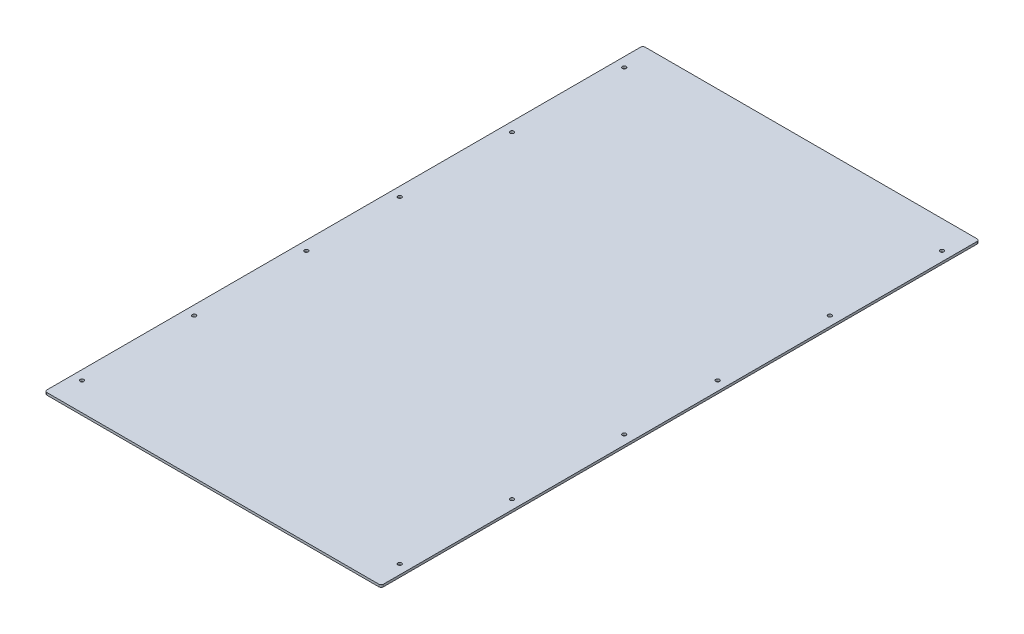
ISO-10303-21;
HEADER;
FILE_DESCRIPTION(('STEP AP214'),'2;1');
FILE_NAME('part.step','',(''),(''),'','','');
FILE_SCHEMA(('AUTOMOTIVE_DESIGN { 1 0 10303 214 1 1 1 1 }'));
ENDSEC;
DATA;
#1=APPLICATION_CONTEXT('core data for automotive mechanical design processes');
#2=APPLICATION_PROTOCOL_DEFINITION('international standard','automotive_design',2000,#1);
#3=PRODUCT_CONTEXT('',#1,'mechanical');
#4=PRODUCT('Part','Part','',(#3));
#5=PRODUCT_RELATED_PRODUCT_CATEGORY('part','',(#4));
#6=PRODUCT_DEFINITION_FORMATION('','',#4);
#7=PRODUCT_DEFINITION_CONTEXT('part definition',#1,'design');
#8=PRODUCT_DEFINITION('design','',#6,#7);
#9=PRODUCT_DEFINITION_SHAPE('','',#8);
#10=(LENGTH_UNIT() NAMED_UNIT(*) SI_UNIT(.MILLI.,.METRE.));
#11=(NAMED_UNIT(*) PLANE_ANGLE_UNIT() SI_UNIT($,.RADIAN.));
#12=(NAMED_UNIT(*) SI_UNIT($,.STERADIAN.) SOLID_ANGLE_UNIT());
#13=UNCERTAINTY_MEASURE_WITH_UNIT(LENGTH_MEASURE(1.E-05),#10,'distance_accuracy_value','');
#14=(GEOMETRIC_REPRESENTATION_CONTEXT(3) GLOBAL_UNCERTAINTY_ASSIGNED_CONTEXT((#13)) GLOBAL_UNIT_ASSIGNED_CONTEXT((#10,
#11,#12)) REPRESENTATION_CONTEXT('',''));
#15=CARTESIAN_POINT('',(0.,0.,0.));
#16=DIRECTION('',(0.,0.,1.));
#17=DIRECTION('',(1.,0.,0.));
#18=AXIS2_PLACEMENT_3D('',#15,#16,#17);
#19=CARTESIAN_POINT('',(228.6,3.175,406.4));
#20=DIRECTION('',(-1.,0.,0.));
#21=DIRECTION('',(0.,0.,1.));
#22=AXIS2_PLACEMENT_3D('',#19,#20,#21);
#23=PLANE('',#22);
#24=DIRECTION('',(0.,0.,-1.));
#25=VECTOR('',#24,1.);
#26=CARTESIAN_POINT('',(228.6,3.175,406.4));
#27=LINE('',#26,#25);
#28=CARTESIAN_POINT('',(228.6,3.175,403.225));
#29=VERTEX_POINT('',#28);
#30=CARTESIAN_POINT('',(228.6,3.175,-403.225));
#31=VERTEX_POINT('',#30);
#32=EDGE_CURVE('E124',#29,#31,#27,.T.);
#33=ORIENTED_EDGE('',*,*,#32,.F.);
#34=DIRECTION('',(0.,-1.,0.));
#35=VECTOR('',#34,1.);
#36=CARTESIAN_POINT('',(228.6,3.175,403.225));
#37=LINE('',#36,#35);
#38=CARTESIAN_POINT('',(228.6,0.,403.225));
#39=VERTEX_POINT('',#38);
#40=EDGE_CURVE('E108',#29,#39,#37,.T.);
#41=ORIENTED_EDGE('',*,*,#40,.T.);
#42=DIRECTION('',(0.,0.,-1.));
#43=VECTOR('',#42,1.);
#44=CARTESIAN_POINT('',(228.6,0.,406.4));
#45=LINE('',#44,#43);
#46=CARTESIAN_POINT('',(228.6,0.,-403.225));
#47=VERTEX_POINT('',#46);
#48=EDGE_CURVE('E121',#39,#47,#45,.T.);
#49=ORIENTED_EDGE('',*,*,#48,.T.);
#50=DIRECTION('',(0.,-1.,0.));
#51=VECTOR('',#50,1.);
#52=CARTESIAN_POINT('',(228.6,3.175,-403.225));
#53=LINE('',#52,#51);
#54=EDGE_CURVE('E127',#47,#31,#53,.F.);
#55=ORIENTED_EDGE('',*,*,#54,.T.);
#56=EDGE_LOOP('',(#33,#41,#49,#55));
#57=FACE_BOUND('',#56,.T.);
#58=ADVANCED_FACE('F36',(#57),#23,.F.);
#59=CARTESIAN_POINT('',(-228.6,3.175,-406.4));
#60=DIRECTION('',(0.,0.,1.));
#61=DIRECTION('',(1.,0.,0.));
#62=AXIS2_PLACEMENT_3D('',#59,#60,#61);
#63=PLANE('',#62);
#64=DIRECTION('',(-1.,0.,0.));
#65=VECTOR('',#64,1.);
#66=CARTESIAN_POINT('',(-228.6,3.175,-406.4));
#67=LINE('',#66,#65);
#68=CARTESIAN_POINT('',(225.425,3.175,-406.4));
#69=VERTEX_POINT('',#68);
#70=CARTESIAN_POINT('',(-225.425,3.175,-406.4));
#71=VERTEX_POINT('',#70);
#72=EDGE_CURVE('E189',#69,#71,#67,.T.);
#73=ORIENTED_EDGE('',*,*,#72,.F.);
#74=DIRECTION('',(0.,-1.,0.));
#75=VECTOR('',#74,1.);
#76=CARTESIAN_POINT('',(225.425,3.175,-406.4));
#77=LINE('',#76,#75);
#78=CARTESIAN_POINT('',(225.425,0.,-406.4));
#79=VERTEX_POINT('',#78);
#80=EDGE_CURVE('E11',#69,#79,#77,.T.);
#81=ORIENTED_EDGE('',*,*,#80,.T.);
#82=DIRECTION('',(-1.,0.,0.));
#83=VECTOR('',#82,1.);
#84=CARTESIAN_POINT('',(-228.6,0.,-406.4));
#85=LINE('',#84,#83);
#86=CARTESIAN_POINT('',(-225.425,0.,-406.4));
#87=VERTEX_POINT('',#86);
#88=EDGE_CURVE('E133',#79,#87,#85,.T.);
#89=ORIENTED_EDGE('',*,*,#88,.T.);
#90=DIRECTION('',(0.,-1.,0.));
#91=VECTOR('',#90,1.);
#92=CARTESIAN_POINT('',(-225.425,3.175,-406.4));
#93=LINE('',#92,#91);
#94=EDGE_CURVE('E45',#87,#71,#93,.F.);
#95=ORIENTED_EDGE('',*,*,#94,.T.);
#96=EDGE_LOOP('',(#73,#81,#89,#95));
#97=FACE_BOUND('',#96,.T.);
#98=ADVANCED_FACE('F188',(#97),#63,.F.);
#99=CARTESIAN_POINT('',(-228.6,3.175,406.4));
#100=DIRECTION('',(1.,0.,0.));
#101=DIRECTION('',(0.,0.,-1.));
#102=AXIS2_PLACEMENT_3D('',#99,#100,#101);
#103=PLANE('',#102);
#104=DIRECTION('',(0.,0.,1.));
#105=VECTOR('',#104,1.);
#106=CARTESIAN_POINT('',(-228.6,0.,406.4));
#107=LINE('',#106,#105);
#108=CARTESIAN_POINT('',(-228.6,0.,-403.225));
#109=VERTEX_POINT('',#108);
#110=CARTESIAN_POINT('',(-228.6,0.,403.225));
#111=VERTEX_POINT('',#110);
#112=EDGE_CURVE('E140',#109,#111,#107,.T.);
#113=ORIENTED_EDGE('',*,*,#112,.T.);
#114=DIRECTION('',(0.,-1.,0.));
#115=VECTOR('',#114,1.);
#116=CARTESIAN_POINT('',(-228.6,3.175,403.225));
#117=LINE('',#116,#115);
#118=CARTESIAN_POINT('',(-228.6,3.175,403.225));
#119=VERTEX_POINT('',#118);
#120=EDGE_CURVE('E52',#111,#119,#117,.F.);
#121=ORIENTED_EDGE('',*,*,#120,.T.);
#122=DIRECTION('',(0.,0.,1.));
#123=VECTOR('',#122,1.);
#124=CARTESIAN_POINT('',(-228.6,3.175,406.4));
#125=LINE('',#124,#123);
#126=CARTESIAN_POINT('',(-228.6,3.175,-403.225));
#127=VERTEX_POINT('',#126);
#128=EDGE_CURVE('E196',#127,#119,#125,.T.);
#129=ORIENTED_EDGE('',*,*,#128,.F.);
#130=DIRECTION('',(0.,-1.,0.));
#131=VECTOR('',#130,1.);
#132=CARTESIAN_POINT('',(-228.6,3.175,-403.225));
#133=LINE('',#132,#131);
#134=EDGE_CURVE('E178',#127,#109,#133,.T.);
#135=ORIENTED_EDGE('',*,*,#134,.T.);
#136=EDGE_LOOP('',(#113,#121,#129,#135));
#137=FACE_BOUND('',#136,.T.);
#138=ADVANCED_FACE('F200',(#137),#103,.F.);
#139=CARTESIAN_POINT('',(-228.6,3.175,406.4));
#140=DIRECTION('',(0.,0.,-1.));
#141=DIRECTION('',(-1.,0.,0.));
#142=AXIS2_PLACEMENT_3D('',#139,#140,#141);
#143=PLANE('',#142);
#144=DIRECTION('',(1.,0.,0.));
#145=VECTOR('',#144,1.);
#146=CARTESIAN_POINT('',(-228.6,0.,406.4));
#147=LINE('',#146,#145);
#148=CARTESIAN_POINT('',(-225.425,0.,406.4));
#149=VERTEX_POINT('',#148);
#150=CARTESIAN_POINT('',(225.425,0.,406.4));
#151=VERTEX_POINT('',#150);
#152=EDGE_CURVE('E151',#149,#151,#147,.T.);
#153=ORIENTED_EDGE('',*,*,#152,.T.);
#154=DIRECTION('',(0.,-1.,0.));
#155=VECTOR('',#154,1.);
#156=CARTESIAN_POINT('',(225.425,3.175,406.4));
#157=LINE('',#156,#155);
#158=CARTESIAN_POINT('',(225.425,3.175,406.4));
#159=VERTEX_POINT('',#158);
#160=EDGE_CURVE('E109',#151,#159,#157,.F.);
#161=ORIENTED_EDGE('',*,*,#160,.T.);
#162=DIRECTION('',(1.,0.,0.));
#163=VECTOR('',#162,1.);
#164=CARTESIAN_POINT('',(-228.6,3.175,406.4));
#165=LINE('',#164,#163);
#166=CARTESIAN_POINT('',(-225.425,3.175,406.4));
#167=VERTEX_POINT('',#166);
#168=EDGE_CURVE('E146',#167,#159,#165,.T.);
#169=ORIENTED_EDGE('',*,*,#168,.F.);
#170=DIRECTION('',(0.,-1.,0.));
#171=VECTOR('',#170,1.);
#172=CARTESIAN_POINT('',(-225.425,3.175,406.4));
#173=LINE('',#172,#171);
#174=EDGE_CURVE('E115',#167,#149,#173,.T.);
#175=ORIENTED_EDGE('',*,*,#174,.T.);
#176=EDGE_LOOP('',(#153,#161,#169,#175));
#177=FACE_BOUND('',#176,.T.);
#178=ADVANCED_FACE('F207',(#177),#143,.F.);
#179=CARTESIAN_POINT('',(0.,3.175,0.));
#180=DIRECTION('',(0.,-1.,0.));
#181=DIRECTION('',(0.,0.,-1.));
#182=AXIS2_PLACEMENT_3D('',#179,#180,#181);
#183=PLANE('',#182);
#184=CARTESIAN_POINT('',(-215.9,3.175,-368.3));
#185=DIRECTION('',(0.,1.,0.));
#186=DIRECTION('',(0.,0.,1.));
#187=AXIS2_PLACEMENT_3D('',#184,#185,#186);
#188=CIRCLE('',#187,2.55269999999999);
#189=CARTESIAN_POINT('',(-215.9,3.175,-365.7473));
#190=VERTEX_POINT('',#189);
#191=EDGE_CURVE('E302',#190,#190,#188,.T.);
#192=ORIENTED_EDGE('',*,*,#191,.F.);
#193=EDGE_LOOP('',(#192));
#194=FACE_BOUND('',#193,.T.);
#195=CARTESIAN_POINT('',(215.9,3.175,-368.3));
#196=DIRECTION('',(0.,1.,0.));
#197=DIRECTION('',(0.,0.,1.));
#198=AXIS2_PLACEMENT_3D('',#195,#196,#197);
#199=CIRCLE('',#198,2.55269999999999);
#200=CARTESIAN_POINT('',(215.9,3.175,-365.7473));
#201=VERTEX_POINT('',#200);
#202=EDGE_CURVE('E294',#201,#201,#199,.T.);
#203=ORIENTED_EDGE('',*,*,#202,.F.);
#204=EDGE_LOOP('',(#203));
#205=FACE_BOUND('',#204,.T.);
#206=CARTESIAN_POINT('',(215.9,3.175,-215.9));
#207=DIRECTION('',(0.,1.,0.));
#208=DIRECTION('',(0.,0.,1.));
#209=AXIS2_PLACEMENT_3D('',#206,#207,#208);
#210=CIRCLE('',#209,2.55269999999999);
#211=CARTESIAN_POINT('',(215.9,3.175,-213.3473));
#212=VERTEX_POINT('',#211);
#213=EDGE_CURVE('E286',#212,#212,#210,.T.);
#214=ORIENTED_EDGE('',*,*,#213,.F.);
#215=EDGE_LOOP('',(#214));
#216=FACE_BOUND('',#215,.T.);
#217=CARTESIAN_POINT('',(215.9,3.175,-63.5000000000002));
#218=DIRECTION('',(0.,1.,0.));
#219=DIRECTION('',(0.,0.,1.));
#220=AXIS2_PLACEMENT_3D('',#217,#218,#219);
#221=CIRCLE('',#220,2.55269999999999);
#222=CARTESIAN_POINT('',(215.9,3.175,-60.9473000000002));
#223=VERTEX_POINT('',#222);
#224=EDGE_CURVE('E278',#223,#223,#221,.T.);
#225=ORIENTED_EDGE('',*,*,#224,.F.);
#226=EDGE_LOOP('',(#225));
#227=FACE_BOUND('',#226,.T.);
#228=CARTESIAN_POINT('',(215.9,3.175,63.4999999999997));
#229=DIRECTION('',(0.,1.,0.));
#230=DIRECTION('',(0.,0.,1.));
#231=AXIS2_PLACEMENT_3D('',#228,#229,#230);
#232=CIRCLE('',#231,2.55269999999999);
#233=CARTESIAN_POINT('',(215.9,3.175,66.0526999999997));
#234=VERTEX_POINT('',#233);
#235=EDGE_CURVE('E270',#234,#234,#232,.T.);
#236=ORIENTED_EDGE('',*,*,#235,.F.);
#237=EDGE_LOOP('',(#236));
#238=FACE_BOUND('',#237,.T.);
#239=CARTESIAN_POINT('',(215.9,3.175,215.9));
#240=DIRECTION('',(0.,1.,0.));
#241=DIRECTION('',(0.,0.,1.));
#242=AXIS2_PLACEMENT_3D('',#239,#240,#241);
#243=CIRCLE('',#242,2.55269999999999);
#244=CARTESIAN_POINT('',(215.9,3.175,218.4527));
#245=VERTEX_POINT('',#244);
#246=EDGE_CURVE('E262',#245,#245,#243,.T.);
#247=ORIENTED_EDGE('',*,*,#246,.F.);
#248=EDGE_LOOP('',(#247));
#249=FACE_BOUND('',#248,.T.);
#250=CARTESIAN_POINT('',(215.9,3.175,368.299999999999));
#251=DIRECTION('',(0.,1.,0.));
#252=DIRECTION('',(0.,0.,1.));
#253=AXIS2_PLACEMENT_3D('',#250,#251,#252);
#254=CIRCLE('',#253,2.55269999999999);
#255=CARTESIAN_POINT('',(215.9,3.175,370.852699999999));
#256=VERTEX_POINT('',#255);
#257=EDGE_CURVE('E254',#256,#256,#254,.T.);
#258=ORIENTED_EDGE('',*,*,#257,.F.);
#259=EDGE_LOOP('',(#258));
#260=FACE_BOUND('',#259,.T.);
#261=CARTESIAN_POINT('',(-215.9,3.175,-215.9));
#262=DIRECTION('',(0.,1.,0.));
#263=DIRECTION('',(0.,0.,1.));
#264=AXIS2_PLACEMENT_3D('',#261,#262,#263);
#265=CIRCLE('',#264,2.55269999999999);
#266=CARTESIAN_POINT('',(-215.9,3.175,-213.3473));
#267=VERTEX_POINT('',#266);
#268=EDGE_CURVE('E246',#267,#267,#265,.T.);
#269=ORIENTED_EDGE('',*,*,#268,.F.);
#270=EDGE_LOOP('',(#269));
#271=FACE_BOUND('',#270,.T.);
#272=CARTESIAN_POINT('',(-215.9,3.175,-63.5000000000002));
#273=DIRECTION('',(0.,1.,0.));
#274=DIRECTION('',(0.,0.,1.));
#275=AXIS2_PLACEMENT_3D('',#272,#273,#274);
#276=CIRCLE('',#275,2.55269999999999);
#277=CARTESIAN_POINT('',(-215.9,3.175,-60.9473000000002));
#278=VERTEX_POINT('',#277);
#279=EDGE_CURVE('E238',#278,#278,#276,.T.);
#280=ORIENTED_EDGE('',*,*,#279,.F.);
#281=EDGE_LOOP('',(#280));
#282=FACE_BOUND('',#281,.T.);
#283=CARTESIAN_POINT('',(-215.9,3.175,63.4999999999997));
#284=DIRECTION('',(0.,1.,0.));
#285=DIRECTION('',(0.,0.,1.));
#286=AXIS2_PLACEMENT_3D('',#283,#284,#285);
#287=CIRCLE('',#286,2.55269999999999);
#288=CARTESIAN_POINT('',(-215.9,3.175,66.0526999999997));
#289=VERTEX_POINT('',#288);
#290=EDGE_CURVE('E230',#289,#289,#287,.T.);
#291=ORIENTED_EDGE('',*,*,#290,.F.);
#292=EDGE_LOOP('',(#291));
#293=FACE_BOUND('',#292,.T.);
#294=CARTESIAN_POINT('',(-215.9,3.175,215.9));
#295=DIRECTION('',(0.,1.,0.));
#296=DIRECTION('',(0.,0.,1.));
#297=AXIS2_PLACEMENT_3D('',#294,#295,#296);
#298=CIRCLE('',#297,2.55269999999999);
#299=CARTESIAN_POINT('',(-215.9,3.175,218.4527));
#300=VERTEX_POINT('',#299);
#301=EDGE_CURVE('E222',#300,#300,#298,.T.);
#302=ORIENTED_EDGE('',*,*,#301,.F.);
#303=EDGE_LOOP('',(#302));
#304=FACE_BOUND('',#303,.T.);
#305=CARTESIAN_POINT('',(-215.9,3.175,368.299999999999));
#306=DIRECTION('',(0.,1.,0.));
#307=DIRECTION('',(0.,0.,1.));
#308=AXIS2_PLACEMENT_3D('',#305,#306,#307);
#309=CIRCLE('',#308,2.55269999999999);
#310=CARTESIAN_POINT('',(-215.9,3.175,370.852699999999));
#311=VERTEX_POINT('',#310);
#312=EDGE_CURVE('E143',#311,#311,#309,.T.);
#313=ORIENTED_EDGE('',*,*,#312,.F.);
#314=EDGE_LOOP('',(#313));
#315=FACE_BOUND('',#314,.T.);
#316=ORIENTED_EDGE('',*,*,#168,.T.);
#317=CARTESIAN_POINT('',(225.425,3.175,403.225));
#318=DIRECTION('',(0.,-1.,0.));
#319=DIRECTION('',(0.,0.,-1.));
#320=AXIS2_PLACEMENT_3D('',#317,#318,#319);
#321=CIRCLE('',#320,3.175);
#322=EDGE_CURVE('E175',#159,#29,#321,.F.);
#323=ORIENTED_EDGE('',*,*,#322,.T.);
#324=ORIENTED_EDGE('',*,*,#32,.T.);
#325=CARTESIAN_POINT('',(225.425,3.175,-403.225));
#326=DIRECTION('',(0.,-1.,0.));
#327=DIRECTION('',(0.,0.,-1.));
#328=AXIS2_PLACEMENT_3D('',#325,#326,#327);
#329=CIRCLE('',#328,3.175);
#330=EDGE_CURVE('E169',#31,#69,#329,.F.);
#331=ORIENTED_EDGE('',*,*,#330,.T.);
#332=ORIENTED_EDGE('',*,*,#72,.T.);
#333=CARTESIAN_POINT('',(-225.425,3.175,-403.225));
#334=DIRECTION('',(0.,-1.,0.));
#335=DIRECTION('',(0.,0.,-1.));
#336=AXIS2_PLACEMENT_3D('',#333,#334,#335);
#337=CIRCLE('',#336,3.175);
#338=EDGE_CURVE('E59',#71,#127,#337,.F.);
#339=ORIENTED_EDGE('',*,*,#338,.T.);
#340=ORIENTED_EDGE('',*,*,#128,.T.);
#341=CARTESIAN_POINT('',(-225.425,3.175,403.225));
#342=DIRECTION('',(0.,-1.,0.));
#343=DIRECTION('',(0.,0.,-1.));
#344=AXIS2_PLACEMENT_3D('',#341,#342,#343);
#345=CIRCLE('',#344,3.175);
#346=EDGE_CURVE('E172',#119,#167,#345,.F.);
#347=ORIENTED_EDGE('',*,*,#346,.T.);
#348=EDGE_LOOP('',(#316,#323,#324,#331,#332,#339,#340,#347));
#349=FACE_BOUND('',#348,.T.);
#350=ADVANCED_FACE('F193',(#194,#205,#216,#227,#238,#249,#260,#271,#282,#293,#304,#315,#349),
#183,.F.);
#351=CARTESIAN_POINT('',(0.,0.,0.));
#352=DIRECTION('',(0.,-1.,0.));
#353=DIRECTION('',(0.,0.,-1.));
#354=AXIS2_PLACEMENT_3D('',#351,#352,#353);
#355=PLANE('',#354);
#356=CARTESIAN_POINT('',(-215.9,0.,-368.3));
#357=DIRECTION('',(0.,1.,0.));
#358=DIRECTION('',(0.,0.,1.));
#359=AXIS2_PLACEMENT_3D('',#356,#357,#358);
#360=CIRCLE('',#359,2.55269999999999);
#361=CARTESIAN_POINT('',(-215.9,0.,-365.7473));
#362=VERTEX_POINT('',#361);
#363=EDGE_CURVE('E298',#362,#362,#360,.T.);
#364=ORIENTED_EDGE('',*,*,#363,.T.);
#365=EDGE_LOOP('',(#364));
#366=FACE_BOUND('',#365,.T.);
#367=CARTESIAN_POINT('',(215.9,0.,-368.3));
#368=DIRECTION('',(0.,1.,0.));
#369=DIRECTION('',(0.,0.,1.));
#370=AXIS2_PLACEMENT_3D('',#367,#368,#369);
#371=CIRCLE('',#370,2.55269999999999);
#372=CARTESIAN_POINT('',(215.9,0.,-365.7473));
#373=VERTEX_POINT('',#372);
#374=EDGE_CURVE('E290',#373,#373,#371,.T.);
#375=ORIENTED_EDGE('',*,*,#374,.T.);
#376=EDGE_LOOP('',(#375));
#377=FACE_BOUND('',#376,.T.);
#378=CARTESIAN_POINT('',(215.9,0.,-215.9));
#379=DIRECTION('',(0.,1.,0.));
#380=DIRECTION('',(0.,0.,1.));
#381=AXIS2_PLACEMENT_3D('',#378,#379,#380);
#382=CIRCLE('',#381,2.55269999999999);
#383=CARTESIAN_POINT('',(215.9,0.,-213.3473));
#384=VERTEX_POINT('',#383);
#385=EDGE_CURVE('E282',#384,#384,#382,.T.);
#386=ORIENTED_EDGE('',*,*,#385,.T.);
#387=EDGE_LOOP('',(#386));
#388=FACE_BOUND('',#387,.T.);
#389=CARTESIAN_POINT('',(215.9,0.,-63.5000000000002));
#390=DIRECTION('',(0.,1.,0.));
#391=DIRECTION('',(0.,0.,1.));
#392=AXIS2_PLACEMENT_3D('',#389,#390,#391);
#393=CIRCLE('',#392,2.55269999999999);
#394=CARTESIAN_POINT('',(215.9,0.,-60.9473000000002));
#395=VERTEX_POINT('',#394);
#396=EDGE_CURVE('E274',#395,#395,#393,.T.);
#397=ORIENTED_EDGE('',*,*,#396,.T.);
#398=EDGE_LOOP('',(#397));
#399=FACE_BOUND('',#398,.T.);
#400=CARTESIAN_POINT('',(215.9,0.,63.4999999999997));
#401=DIRECTION('',(0.,1.,0.));
#402=DIRECTION('',(0.,0.,1.));
#403=AXIS2_PLACEMENT_3D('',#400,#401,#402);
#404=CIRCLE('',#403,2.55269999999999);
#405=CARTESIAN_POINT('',(215.9,0.,66.0526999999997));
#406=VERTEX_POINT('',#405);
#407=EDGE_CURVE('E266',#406,#406,#404,.T.);
#408=ORIENTED_EDGE('',*,*,#407,.T.);
#409=EDGE_LOOP('',(#408));
#410=FACE_BOUND('',#409,.T.);
#411=CARTESIAN_POINT('',(215.9,0.,215.9));
#412=DIRECTION('',(0.,1.,0.));
#413=DIRECTION('',(0.,0.,1.));
#414=AXIS2_PLACEMENT_3D('',#411,#412,#413);
#415=CIRCLE('',#414,2.55269999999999);
#416=CARTESIAN_POINT('',(215.9,0.,218.4527));
#417=VERTEX_POINT('',#416);
#418=EDGE_CURVE('E258',#417,#417,#415,.T.);
#419=ORIENTED_EDGE('',*,*,#418,.T.);
#420=EDGE_LOOP('',(#419));
#421=FACE_BOUND('',#420,.T.);
#422=CARTESIAN_POINT('',(215.9,0.,368.299999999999));
#423=DIRECTION('',(0.,1.,0.));
#424=DIRECTION('',(0.,0.,1.));
#425=AXIS2_PLACEMENT_3D('',#422,#423,#424);
#426=CIRCLE('',#425,2.55269999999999);
#427=CARTESIAN_POINT('',(215.9,0.,370.852699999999));
#428=VERTEX_POINT('',#427);
#429=EDGE_CURVE('E250',#428,#428,#426,.T.);
#430=ORIENTED_EDGE('',*,*,#429,.T.);
#431=EDGE_LOOP('',(#430));
#432=FACE_BOUND('',#431,.T.);
#433=CARTESIAN_POINT('',(-215.9,0.,-215.9));
#434=DIRECTION('',(0.,1.,0.));
#435=DIRECTION('',(0.,0.,1.));
#436=AXIS2_PLACEMENT_3D('',#433,#434,#435);
#437=CIRCLE('',#436,2.55269999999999);
#438=CARTESIAN_POINT('',(-215.9,0.,-213.3473));
#439=VERTEX_POINT('',#438);
#440=EDGE_CURVE('E242',#439,#439,#437,.T.);
#441=ORIENTED_EDGE('',*,*,#440,.T.);
#442=EDGE_LOOP('',(#441));
#443=FACE_BOUND('',#442,.T.);
#444=CARTESIAN_POINT('',(-215.9,0.,-63.5000000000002));
#445=DIRECTION('',(0.,1.,0.));
#446=DIRECTION('',(0.,0.,1.));
#447=AXIS2_PLACEMENT_3D('',#444,#445,#446);
#448=CIRCLE('',#447,2.55269999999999);
#449=CARTESIAN_POINT('',(-215.9,0.,-60.9473000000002));
#450=VERTEX_POINT('',#449);
#451=EDGE_CURVE('E234',#450,#450,#448,.T.);
#452=ORIENTED_EDGE('',*,*,#451,.T.);
#453=EDGE_LOOP('',(#452));
#454=FACE_BOUND('',#453,.T.);
#455=CARTESIAN_POINT('',(-215.9,0.,63.4999999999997));
#456=DIRECTION('',(0.,1.,0.));
#457=DIRECTION('',(0.,0.,1.));
#458=AXIS2_PLACEMENT_3D('',#455,#456,#457);
#459=CIRCLE('',#458,2.55269999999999);
#460=CARTESIAN_POINT('',(-215.9,0.,66.0526999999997));
#461=VERTEX_POINT('',#460);
#462=EDGE_CURVE('E226',#461,#461,#459,.T.);
#463=ORIENTED_EDGE('',*,*,#462,.T.);
#464=EDGE_LOOP('',(#463));
#465=FACE_BOUND('',#464,.T.);
#466=CARTESIAN_POINT('',(-215.9,0.,215.9));
#467=DIRECTION('',(0.,1.,0.));
#468=DIRECTION('',(0.,0.,1.));
#469=AXIS2_PLACEMENT_3D('',#466,#467,#468);
#470=CIRCLE('',#469,2.55269999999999);
#471=CARTESIAN_POINT('',(-215.9,0.,218.4527));
#472=VERTEX_POINT('',#471);
#473=EDGE_CURVE('E218',#472,#472,#470,.T.);
#474=ORIENTED_EDGE('',*,*,#473,.T.);
#475=EDGE_LOOP('',(#474));
#476=FACE_BOUND('',#475,.T.);
#477=CARTESIAN_POINT('',(-215.9,0.,368.299999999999));
#478=DIRECTION('',(0.,1.,0.));
#479=DIRECTION('',(0.,0.,1.));
#480=AXIS2_PLACEMENT_3D('',#477,#478,#479);
#481=CIRCLE('',#480,2.55269999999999);
#482=CARTESIAN_POINT('',(-215.9,0.,370.852699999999));
#483=VERTEX_POINT('',#482);
#484=EDGE_CURVE('E134',#483,#483,#481,.T.);
#485=ORIENTED_EDGE('',*,*,#484,.T.);
#486=EDGE_LOOP('',(#485));
#487=FACE_BOUND('',#486,.T.);
#488=ORIENTED_EDGE('',*,*,#48,.F.);
#489=CARTESIAN_POINT('',(225.425,0.,403.225));
#490=DIRECTION('',(0.,-1.,0.));
#491=DIRECTION('',(0.,0.,-1.));
#492=AXIS2_PLACEMENT_3D('',#489,#490,#491);
#493=CIRCLE('',#492,3.175);
#494=EDGE_CURVE('E104',#39,#151,#493,.T.);
#495=ORIENTED_EDGE('',*,*,#494,.T.);
#496=ORIENTED_EDGE('',*,*,#152,.F.);
#497=CARTESIAN_POINT('',(-225.425,0.,403.225));
#498=DIRECTION('',(0.,-1.,0.));
#499=DIRECTION('',(0.,0.,-1.));
#500=AXIS2_PLACEMENT_3D('',#497,#498,#499);
#501=CIRCLE('',#500,3.175);
#502=EDGE_CURVE('E116',#149,#111,#501,.T.);
#503=ORIENTED_EDGE('',*,*,#502,.T.);
#504=ORIENTED_EDGE('',*,*,#112,.F.);
#505=CARTESIAN_POINT('',(-225.425,0.,-403.225));
#506=DIRECTION('',(0.,-1.,0.));
#507=DIRECTION('',(0.,0.,-1.));
#508=AXIS2_PLACEMENT_3D('',#505,#506,#507);
#509=CIRCLE('',#508,3.175);
#510=EDGE_CURVE('E126',#109,#87,#509,.T.);
#511=ORIENTED_EDGE('',*,*,#510,.T.);
#512=ORIENTED_EDGE('',*,*,#88,.F.);
#513=CARTESIAN_POINT('',(225.425,0.,-403.225));
#514=DIRECTION('',(0.,-1.,0.));
#515=DIRECTION('',(0.,0.,-1.));
#516=AXIS2_PLACEMENT_3D('',#513,#514,#515);
#517=CIRCLE('',#516,3.175);
#518=EDGE_CURVE('E131',#79,#47,#517,.T.);
#519=ORIENTED_EDGE('',*,*,#518,.T.);
#520=EDGE_LOOP('',(#488,#495,#496,#503,#504,#511,#512,#519));
#521=FACE_BOUND('',#520,.T.);
#522=ADVANCED_FACE('F129',(#366,#377,#388,#399,#410,#421,#432,#443,#454,#465,#476,#487,#521),
#355,.T.);
#523=CARTESIAN_POINT('',(-215.9,3.175,368.299999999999));
#524=DIRECTION('',(0.,1.,0.));
#525=DIRECTION('',(0.,0.,1.));
#526=AXIS2_PLACEMENT_3D('',#523,#524,#525);
#527=CYLINDRICAL_SURFACE('',#526,2.55269999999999);
#528=ORIENTED_EDGE('',*,*,#484,.F.);
#529=EDGE_LOOP('',(#528));
#530=FACE_BOUND('',#529,.T.);
#531=ORIENTED_EDGE('',*,*,#312,.T.);
#532=EDGE_LOOP('',(#531));
#533=FACE_BOUND('',#532,.T.);
#534=ADVANCED_FACE('F335',(#530,#533),#527,.F.);
#535=CARTESIAN_POINT('',(-215.9,3.175,215.9));
#536=DIRECTION('',(0.,1.,0.));
#537=DIRECTION('',(0.,0.,1.));
#538=AXIS2_PLACEMENT_3D('',#535,#536,#537);
#539=CYLINDRICAL_SURFACE('',#538,2.55269999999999);
#540=ORIENTED_EDGE('',*,*,#473,.F.);
#541=EDGE_LOOP('',(#540));
#542=FACE_BOUND('',#541,.T.);
#543=ORIENTED_EDGE('',*,*,#301,.T.);
#544=EDGE_LOOP('',(#543));
#545=FACE_BOUND('',#544,.T.);
#546=ADVANCED_FACE('F337',(#542,#545),#539,.F.);
#547=CARTESIAN_POINT('',(-215.9,3.175,63.4999999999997));
#548=DIRECTION('',(0.,1.,0.));
#549=DIRECTION('',(0.,0.,1.));
#550=AXIS2_PLACEMENT_3D('',#547,#548,#549);
#551=CYLINDRICAL_SURFACE('',#550,2.55269999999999);
#552=ORIENTED_EDGE('',*,*,#462,.F.);
#553=EDGE_LOOP('',(#552));
#554=FACE_BOUND('',#553,.T.);
#555=ORIENTED_EDGE('',*,*,#290,.T.);
#556=EDGE_LOOP('',(#555));
#557=FACE_BOUND('',#556,.T.);
#558=ADVANCED_FACE('F344',(#554,#557),#551,.F.);
#559=CARTESIAN_POINT('',(-215.9,3.175,-63.5000000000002));
#560=DIRECTION('',(0.,1.,0.));
#561=DIRECTION('',(0.,0.,1.));
#562=AXIS2_PLACEMENT_3D('',#559,#560,#561);
#563=CYLINDRICAL_SURFACE('',#562,2.55269999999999);
#564=ORIENTED_EDGE('',*,*,#451,.F.);
#565=EDGE_LOOP('',(#564));
#566=FACE_BOUND('',#565,.T.);
#567=ORIENTED_EDGE('',*,*,#279,.T.);
#568=EDGE_LOOP('',(#567));
#569=FACE_BOUND('',#568,.T.);
#570=ADVANCED_FACE('F466',(#566,#569),#563,.F.);
#571=CARTESIAN_POINT('',(-215.9,3.175,-215.9));
#572=DIRECTION('',(0.,1.,0.));
#573=DIRECTION('',(0.,0.,1.));
#574=AXIS2_PLACEMENT_3D('',#571,#572,#573);
#575=CYLINDRICAL_SURFACE('',#574,2.55269999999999);
#576=ORIENTED_EDGE('',*,*,#440,.F.);
#577=EDGE_LOOP('',(#576));
#578=FACE_BOUND('',#577,.T.);
#579=ORIENTED_EDGE('',*,*,#268,.T.);
#580=EDGE_LOOP('',(#579));
#581=FACE_BOUND('',#580,.T.);
#582=ADVANCED_FACE('F456',(#578,#581),#575,.F.);
#583=CARTESIAN_POINT('',(215.9,3.175,368.299999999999));
#584=DIRECTION('',(0.,1.,0.));
#585=DIRECTION('',(0.,0.,1.));
#586=AXIS2_PLACEMENT_3D('',#583,#584,#585);
#587=CYLINDRICAL_SURFACE('',#586,2.55269999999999);
#588=ORIENTED_EDGE('',*,*,#429,.F.);
#589=EDGE_LOOP('',(#588));
#590=FACE_BOUND('',#589,.T.);
#591=ORIENTED_EDGE('',*,*,#257,.T.);
#592=EDGE_LOOP('',(#591));
#593=FACE_BOUND('',#592,.T.);
#594=ADVANCED_FACE('F446',(#590,#593),#587,.F.);
#595=CARTESIAN_POINT('',(215.9,3.175,215.9));
#596=DIRECTION('',(0.,1.,0.));
#597=DIRECTION('',(0.,0.,1.));
#598=AXIS2_PLACEMENT_3D('',#595,#596,#597);
#599=CYLINDRICAL_SURFACE('',#598,2.55269999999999);
#600=ORIENTED_EDGE('',*,*,#418,.F.);
#601=EDGE_LOOP('',(#600));
#602=FACE_BOUND('',#601,.T.);
#603=ORIENTED_EDGE('',*,*,#246,.T.);
#604=EDGE_LOOP('',(#603));
#605=FACE_BOUND('',#604,.T.);
#606=ADVANCED_FACE('F436',(#602,#605),#599,.F.);
#607=CARTESIAN_POINT('',(215.9,3.175,63.4999999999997));
#608=DIRECTION('',(0.,1.,0.));
#609=DIRECTION('',(0.,0.,1.));
#610=AXIS2_PLACEMENT_3D('',#607,#608,#609);
#611=CYLINDRICAL_SURFACE('',#610,2.55269999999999);
#612=ORIENTED_EDGE('',*,*,#407,.F.);
#613=EDGE_LOOP('',(#612));
#614=FACE_BOUND('',#613,.T.);
#615=ORIENTED_EDGE('',*,*,#235,.T.);
#616=EDGE_LOOP('',(#615));
#617=FACE_BOUND('',#616,.T.);
#618=ADVANCED_FACE('F426',(#614,#617),#611,.F.);
#619=CARTESIAN_POINT('',(215.9,3.175,-63.5000000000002));
#620=DIRECTION('',(0.,1.,0.));
#621=DIRECTION('',(0.,0.,1.));
#622=AXIS2_PLACEMENT_3D('',#619,#620,#621);
#623=CYLINDRICAL_SURFACE('',#622,2.55269999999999);
#624=ORIENTED_EDGE('',*,*,#396,.F.);
#625=EDGE_LOOP('',(#624));
#626=FACE_BOUND('',#625,.T.);
#627=ORIENTED_EDGE('',*,*,#224,.T.);
#628=EDGE_LOOP('',(#627));
#629=FACE_BOUND('',#628,.T.);
#630=ADVANCED_FACE('F416',(#626,#629),#623,.F.);
#631=CARTESIAN_POINT('',(215.9,3.175,-215.9));
#632=DIRECTION('',(0.,1.,0.));
#633=DIRECTION('',(0.,0.,1.));
#634=AXIS2_PLACEMENT_3D('',#631,#632,#633);
#635=CYLINDRICAL_SURFACE('',#634,2.55269999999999);
#636=ORIENTED_EDGE('',*,*,#385,.F.);
#637=EDGE_LOOP('',(#636));
#638=FACE_BOUND('',#637,.T.);
#639=ORIENTED_EDGE('',*,*,#213,.T.);
#640=EDGE_LOOP('',(#639));
#641=FACE_BOUND('',#640,.T.);
#642=ADVANCED_FACE('F406',(#638,#641),#635,.F.);
#643=CARTESIAN_POINT('',(215.9,3.175,-368.3));
#644=DIRECTION('',(0.,1.,0.));
#645=DIRECTION('',(0.,0.,1.));
#646=AXIS2_PLACEMENT_3D('',#643,#644,#645);
#647=CYLINDRICAL_SURFACE('',#646,2.55269999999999);
#648=ORIENTED_EDGE('',*,*,#374,.F.);
#649=EDGE_LOOP('',(#648));
#650=FACE_BOUND('',#649,.T.);
#651=ORIENTED_EDGE('',*,*,#202,.T.);
#652=EDGE_LOOP('',(#651));
#653=FACE_BOUND('',#652,.T.);
#654=ADVANCED_FACE('F395',(#650,#653),#647,.F.);
#655=CARTESIAN_POINT('',(-215.9,3.175,-368.3));
#656=DIRECTION('',(0.,1.,0.));
#657=DIRECTION('',(0.,0.,1.));
#658=AXIS2_PLACEMENT_3D('',#655,#656,#657);
#659=CYLINDRICAL_SURFACE('',#658,2.55269999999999);
#660=ORIENTED_EDGE('',*,*,#363,.F.);
#661=EDGE_LOOP('',(#660));
#662=FACE_BOUND('',#661,.T.);
#663=ORIENTED_EDGE('',*,*,#191,.T.);
#664=EDGE_LOOP('',(#663));
#665=FACE_BOUND('',#664,.T.);
#666=ADVANCED_FACE('F308',(#662,#665),#659,.F.);
#667=CARTESIAN_POINT('',(225.425,3.175,403.225));
#668=DIRECTION('',(0.,-1.,0.));
#669=DIRECTION('',(0.,0.,-1.));
#670=AXIS2_PLACEMENT_3D('',#667,#668,#669);
#671=CYLINDRICAL_SURFACE('',#670,3.175);
#672=ORIENTED_EDGE('',*,*,#322,.F.);
#673=ORIENTED_EDGE('',*,*,#160,.F.);
#674=ORIENTED_EDGE('',*,*,#494,.F.);
#675=ORIENTED_EDGE('',*,*,#40,.F.);
#676=EDGE_LOOP('',(#672,#673,#674,#675));
#677=FACE_BOUND('',#676,.T.);
#678=ADVANCED_FACE('F107',(#677),#671,.T.);
#679=CARTESIAN_POINT('',(-225.425,3.175,403.225));
#680=DIRECTION('',(0.,-1.,0.));
#681=DIRECTION('',(0.,0.,-1.));
#682=AXIS2_PLACEMENT_3D('',#679,#680,#681);
#683=CYLINDRICAL_SURFACE('',#682,3.175);
#684=ORIENTED_EDGE('',*,*,#346,.F.);
#685=ORIENTED_EDGE('',*,*,#120,.F.);
#686=ORIENTED_EDGE('',*,*,#502,.F.);
#687=ORIENTED_EDGE('',*,*,#174,.F.);
#688=EDGE_LOOP('',(#684,#685,#686,#687));
#689=FACE_BOUND('',#688,.T.);
#690=ADVANCED_FACE('F204',(#689),#683,.T.);
#691=CARTESIAN_POINT('',(225.425,3.175,-403.225));
#692=DIRECTION('',(0.,-1.,0.));
#693=DIRECTION('',(0.,0.,-1.));
#694=AXIS2_PLACEMENT_3D('',#691,#692,#693);
#695=CYLINDRICAL_SURFACE('',#694,3.175);
#696=ORIENTED_EDGE('',*,*,#330,.F.);
#697=ORIENTED_EDGE('',*,*,#54,.F.);
#698=ORIENTED_EDGE('',*,*,#518,.F.);
#699=ORIENTED_EDGE('',*,*,#80,.F.);
#700=EDGE_LOOP('',(#696,#697,#698,#699));
#701=FACE_BOUND('',#700,.T.);
#702=ADVANCED_FACE('F361',(#701),#695,.T.);
#703=CARTESIAN_POINT('',(-225.425,3.175,-403.225));
#704=DIRECTION('',(0.,-1.,0.));
#705=DIRECTION('',(0.,0.,-1.));
#706=AXIS2_PLACEMENT_3D('',#703,#704,#705);
#707=CYLINDRICAL_SURFACE('',#706,3.175);
#708=ORIENTED_EDGE('',*,*,#338,.F.);
#709=ORIENTED_EDGE('',*,*,#94,.F.);
#710=ORIENTED_EDGE('',*,*,#510,.F.);
#711=ORIENTED_EDGE('',*,*,#134,.F.);
#712=EDGE_LOOP('',(#708,#709,#710,#711));
#713=FACE_BOUND('',#712,.T.);
#714=ADVANCED_FACE('F38',(#713),#707,.T.);
#715=CLOSED_SHELL('',(#58,#98,#138,#178,#350,#522,#534,#546,#558,#570,#582,#594,#606,#618,#630,
#642,#654,#666,#678,#690,#702,#714));
#716=MANIFOLD_SOLID_BREP('B2',#715);
#717=ADVANCED_BREP_SHAPE_REPRESENTATION('',(#18,#716),#14);
#718=SHAPE_DEFINITION_REPRESENTATION(#9,#717);
ENDSEC;
END-ISO-10303-21;
